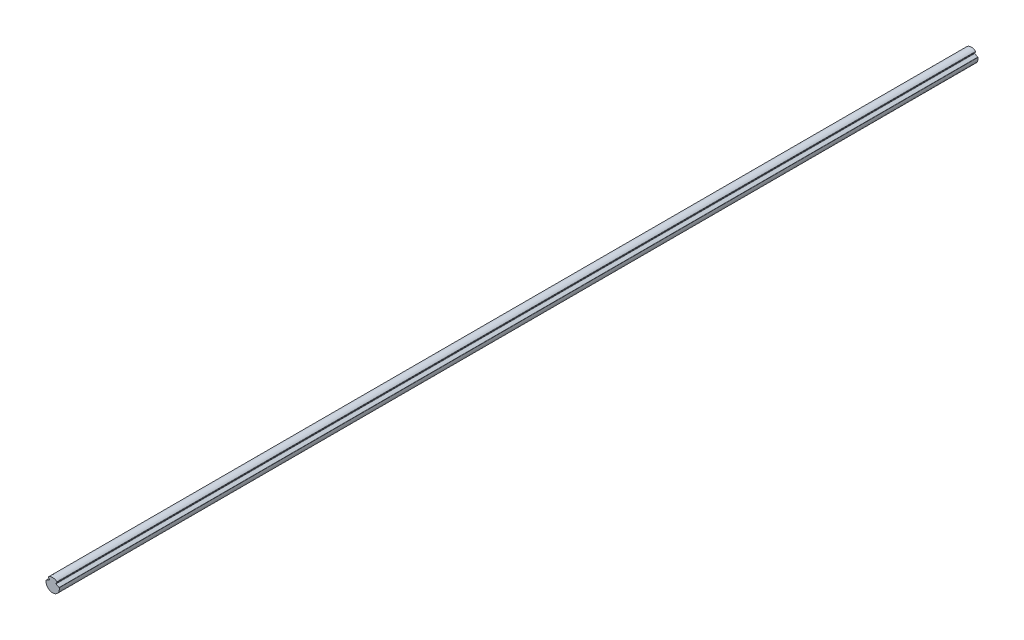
ISO-10303-21;
HEADER;
FILE_DESCRIPTION(('STEP AP214'),'2;1');
FILE_NAME('part.step','',(''),(''),'','','');
FILE_SCHEMA(('AUTOMOTIVE_DESIGN { 1 0 10303 214 1 1 1 1 }'));
ENDSEC;
DATA;
#1=APPLICATION_CONTEXT('core data for automotive mechanical design processes');
#2=APPLICATION_PROTOCOL_DEFINITION('international standard','automotive_design',2000,#1);
#3=PRODUCT_CONTEXT('',#1,'mechanical');
#4=PRODUCT('Part','Part','',(#3));
#5=PRODUCT_RELATED_PRODUCT_CATEGORY('part','',(#4));
#6=PRODUCT_DEFINITION_FORMATION('','',#4);
#7=PRODUCT_DEFINITION_CONTEXT('part definition',#1,'design');
#8=PRODUCT_DEFINITION('design','',#6,#7);
#9=PRODUCT_DEFINITION_SHAPE('','',#8);
#10=(LENGTH_UNIT() NAMED_UNIT(*) SI_UNIT(.MILLI.,.METRE.));
#11=(NAMED_UNIT(*) PLANE_ANGLE_UNIT() SI_UNIT($,.RADIAN.));
#12=(NAMED_UNIT(*) SI_UNIT($,.STERADIAN.) SOLID_ANGLE_UNIT());
#13=UNCERTAINTY_MEASURE_WITH_UNIT(LENGTH_MEASURE(1.E-05),#10,'distance_accuracy_value','');
#14=(GEOMETRIC_REPRESENTATION_CONTEXT(3) GLOBAL_UNCERTAINTY_ASSIGNED_CONTEXT((#13)) GLOBAL_UNIT_ASSIGNED_CONTEXT((#10,
#11,#12)) REPRESENTATION_CONTEXT('',''));
#15=CARTESIAN_POINT('',(0.,0.,0.));
#16=DIRECTION('',(0.,0.,1.));
#17=DIRECTION('',(1.,0.,0.));
#18=AXIS2_PLACEMENT_3D('',#15,#16,#17);
#19=CARTESIAN_POINT('',(-4.37305574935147,5.27246464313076,1000.));
#20=DIRECTION('',(0.,0.,-1.));
#21=DIRECTION('',(-1.,0.,0.));
#22=AXIS2_PLACEMENT_3D('',#19,#20,#21);
#23=CYLINDRICAL_SURFACE('',#22,0.400000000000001);
#24=CARTESIAN_POINT('',(-4.37305574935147,5.27246464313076,0.));
#25=DIRECTION('',(0.,0.,1.));
#26=DIRECTION('',(-1.,0.,0.));
#27=AXIS2_PLACEMENT_3D('',#24,#25,#26);
#28=CIRCLE('',#27,0.400000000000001);
#29=CARTESIAN_POINT('',(-4.62841666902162,5.58034579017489,0.));
#30=VERTEX_POINT('',#29);
#31=CARTESIAN_POINT('',(-4.68391413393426,5.02073648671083,0.));
#32=VERTEX_POINT('',#31);
#33=EDGE_CURVE('E158',#30,#32,#28,.T.);
#34=ORIENTED_EDGE('',*,*,#33,.T.);
#35=DIRECTION('',(0.,0.,-1.));
#36=VECTOR('',#35,1.);
#37=CARTESIAN_POINT('',(-4.68391413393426,5.02073648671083,1000.));
#38=LINE('',#37,#36);
#39=CARTESIAN_POINT('',(-4.68391413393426,5.02073648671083,1000.));
#40=VERTEX_POINT('',#39);
#41=EDGE_CURVE('E11',#40,#32,#38,.T.);
#42=ORIENTED_EDGE('',*,*,#41,.F.);
#43=CARTESIAN_POINT('',(-4.37305574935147,5.27246464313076,1000.));
#44=DIRECTION('',(0.,0.,1.));
#45=DIRECTION('',(-1.,0.,0.));
#46=AXIS2_PLACEMENT_3D('',#43,#44,#45);
#47=CIRCLE('',#46,0.400000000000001);
#48=CARTESIAN_POINT('',(-4.62841666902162,5.58034579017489,1000.));
#49=VERTEX_POINT('',#48);
#50=EDGE_CURVE('E180',#49,#40,#47,.T.);
#51=ORIENTED_EDGE('',*,*,#50,.F.);
#52=DIRECTION('',(0.,0.,-1.));
#53=VECTOR('',#52,1.);
#54=CARTESIAN_POINT('',(-4.62841666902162,5.58034579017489,1000.));
#55=LINE('',#54,#53);
#56=EDGE_CURVE('E154',#49,#30,#55,.T.);
#57=ORIENTED_EDGE('',*,*,#56,.T.);
#58=EDGE_LOOP('',(#34,#42,#51,#57));
#59=FACE_BOUND('',#58,.T.);
#60=ADVANCED_FACE('F38',(#59),#23,.T.);
#61=CARTESIAN_POINT('',(-3.56085838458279,3.63387813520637,1000.));
#62=DIRECTION('',(0.777145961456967,0.629320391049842,0.));
#63=DIRECTION('',(-0.629320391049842,0.777145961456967,0.));
#64=AXIS2_PLACEMENT_3D('',#61,#62,#63);
#65=PLANE('',#64);
#66=DIRECTION('',(0.629320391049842,-0.777145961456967,0.));
#67=VECTOR('',#66,1.);
#68=CARTESIAN_POINT('',(-3.56085838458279,3.63387813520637,0.));
#69=LINE('',#68,#67);
#70=CARTESIAN_POINT('',(-3.56085838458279,3.63387813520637,0.));
#71=VERTEX_POINT('',#70);
#72=EDGE_CURVE('E161',#32,#71,#69,.T.);
#73=ORIENTED_EDGE('',*,*,#72,.T.);
#74=DIRECTION('',(0.,0.,-1.));
#75=VECTOR('',#74,1.);
#76=CARTESIAN_POINT('',(-3.56085838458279,3.63387813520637,1000.));
#77=LINE('',#76,#75);
#78=CARTESIAN_POINT('',(-3.56085838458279,3.63387813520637,1000.));
#79=VERTEX_POINT('',#78);
#80=EDGE_CURVE('E46',#79,#71,#77,.T.);
#81=ORIENTED_EDGE('',*,*,#80,.F.);
#82=DIRECTION('',(0.629320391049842,-0.777145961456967,0.));
#83=VECTOR('',#82,1.);
#84=CARTESIAN_POINT('',(-3.56085838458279,3.63387813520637,1000.));
#85=LINE('',#84,#83);
#86=EDGE_CURVE('E109',#40,#79,#85,.T.);
#87=ORIENTED_EDGE('',*,*,#86,.F.);
#88=ORIENTED_EDGE('',*,*,#41,.T.);
#89=EDGE_LOOP('',(#73,#81,#87,#88));
#90=FACE_BOUND('',#89,.T.);
#91=ADVANCED_FACE('F258',(#90),#65,.F.);
#92=CARTESIAN_POINT('',(-3.87171676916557,3.38214997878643,1000.));
#93=DIRECTION('',(0.,0.,-1.));
#94=DIRECTION('',(-1.,0.,0.));
#95=AXIS2_PLACEMENT_3D('',#92,#93,#94);
#96=CYLINDRICAL_SURFACE('',#95,0.4);
#97=CARTESIAN_POINT('',(-3.87171676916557,3.38214997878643,0.));
#98=DIRECTION('',(0.,0.,-1.));
#99=DIRECTION('',(1.,0.,0.));
#100=AXIS2_PLACEMENT_3D('',#97,#98,#99);
#101=CIRCLE('',#100,0.4);
#102=CARTESIAN_POINT('',(-3.69012056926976,3.02574736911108,0.));
#103=VERTEX_POINT('',#102);
#104=EDGE_CURVE('E163',#71,#103,#101,.T.);
#105=ORIENTED_EDGE('',*,*,#104,.T.);
#106=DIRECTION('',(0.,0.,-1.));
#107=VECTOR('',#106,1.);
#108=CARTESIAN_POINT('',(-3.69012056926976,3.02574736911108,1000.));
#109=LINE('',#108,#107);
#110=CARTESIAN_POINT('',(-3.69012056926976,3.02574736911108,1000.));
#111=VERTEX_POINT('',#110);
#112=EDGE_CURVE('E199',#111,#103,#109,.T.);
#113=ORIENTED_EDGE('',*,*,#112,.F.);
#114=CARTESIAN_POINT('',(-3.87171676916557,3.38214997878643,1000.));
#115=DIRECTION('',(0.,0.,-1.));
#116=DIRECTION('',(1.,0.,0.));
#117=AXIS2_PLACEMENT_3D('',#114,#115,#116);
#118=CIRCLE('',#117,0.4);
#119=EDGE_CURVE('E207',#79,#111,#118,.T.);
#120=ORIENTED_EDGE('',*,*,#119,.F.);
#121=ORIENTED_EDGE('',*,*,#80,.T.);
#122=EDGE_LOOP('',(#105,#113,#120,#121));
#123=FACE_BOUND('',#122,.T.);
#124=ADVANCED_FACE('F205',(#123),#96,.F.);
#125=CARTESIAN_POINT('',(-3.69012056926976,3.02574736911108,1000.));
#126=DIRECTION('',(0.453990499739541,-0.891006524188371,0.));
#127=DIRECTION('',(0.891006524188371,0.453990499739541,0.));
#128=AXIS2_PLACEMENT_3D('',#125,#126,#127);
#129=PLANE('',#128);
#130=DIRECTION('',(-0.891006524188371,-0.453990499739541,0.));
#131=VECTOR('',#130,1.);
#132=CARTESIAN_POINT('',(-3.69012056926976,3.02574736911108,0.));
#133=LINE('',#132,#131);
#134=CARTESIAN_POINT('',(-6.95754338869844,1.36091228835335,0.));
#135=VERTEX_POINT('',#134);
#136=EDGE_CURVE('E165',#103,#135,#133,.T.);
#137=ORIENTED_EDGE('',*,*,#136,.T.);
#138=DIRECTION('',(0.,0.,-1.));
#139=VECTOR('',#138,1.);
#140=CARTESIAN_POINT('',(-6.95754338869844,1.36091228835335,1000.));
#141=LINE('',#140,#139);
#142=CARTESIAN_POINT('',(-6.95754338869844,1.36091228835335,1000.));
#143=VERTEX_POINT('',#142);
#144=EDGE_CURVE('E196',#143,#135,#141,.T.);
#145=ORIENTED_EDGE('',*,*,#144,.F.);
#146=DIRECTION('',(-0.891006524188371,-0.453990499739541,0.));
#147=VECTOR('',#146,1.);
#148=CARTESIAN_POINT('',(-3.69012056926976,3.02574736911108,1000.));
#149=LINE('',#148,#147);
#150=EDGE_CURVE('E225',#111,#143,#149,.T.);
#151=ORIENTED_EDGE('',*,*,#150,.F.);
#152=ORIENTED_EDGE('',*,*,#112,.T.);
#153=EDGE_LOOP('',(#137,#145,#151,#152));
#154=FACE_BOUND('',#153,.T.);
#155=ADVANCED_FACE('F216',(#154),#129,.F.);
#156=CARTESIAN_POINT('',(-6.77594718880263,1.004509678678,1000.));
#157=DIRECTION('',(0.,0.,-1.));
#158=DIRECTION('',(-1.,0.,0.));
#159=AXIS2_PLACEMENT_3D('',#156,#157,#158);
#160=CYLINDRICAL_SURFACE('',#159,0.400000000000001);
#161=CARTESIAN_POINT('',(-6.77594718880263,1.004509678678,0.));
#162=DIRECTION('',(0.,0.,1.));
#163=DIRECTION('',(1.,0.,0.));
#164=AXIS2_PLACEMENT_3D('',#161,#162,#163);
#165=CIRCLE('',#164,0.400000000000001);
#166=CARTESIAN_POINT('',(-7.17162293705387,1.06316717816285,0.));
#167=VERTEX_POINT('',#166);
#168=EDGE_CURVE('E167',#135,#167,#165,.T.);
#169=ORIENTED_EDGE('',*,*,#168,.T.);
#170=DIRECTION('',(0.,0.,-1.));
#171=VECTOR('',#170,1.);
#172=CARTESIAN_POINT('',(-7.17162293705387,1.06316717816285,1000.));
#173=LINE('',#172,#171);
#174=CARTESIAN_POINT('',(-7.17162293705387,1.06316717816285,1000.));
#175=VERTEX_POINT('',#174);
#176=EDGE_CURVE('E193',#175,#167,#173,.T.);
#177=ORIENTED_EDGE('',*,*,#176,.F.);
#178=CARTESIAN_POINT('',(-6.77594718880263,1.004509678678,1000.));
#179=DIRECTION('',(0.,0.,1.));
#180=DIRECTION('',(1.,0.,0.));
#181=AXIS2_PLACEMENT_3D('',#178,#179,#180);
#182=CIRCLE('',#181,0.400000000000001);
#183=EDGE_CURVE('E222',#143,#175,#182,.T.);
#184=ORIENTED_EDGE('',*,*,#183,.F.);
#185=ORIENTED_EDGE('',*,*,#144,.T.);
#186=EDGE_LOOP('',(#169,#177,#184,#185));
#187=FACE_BOUND('',#186,.T.);
#188=ADVANCED_FACE('F220',(#187),#160,.T.);
#189=CARTESIAN_POINT('',(0.,0.,1000.));
#190=DIRECTION('',(0.,0.,-1.));
#191=DIRECTION('',(-1.,0.,0.));
#192=AXIS2_PLACEMENT_3D('',#189,#190,#191);
#193=CYLINDRICAL_SURFACE('',#192,7.24999999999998);
#194=CARTESIAN_POINT('',(0.,0.,0.));
#195=DIRECTION('',(0.,0.,1.));
#196=DIRECTION('',(1.,0.,0.));
#197=AXIS2_PLACEMENT_3D('',#194,#195,#196);
#198=CIRCLE('',#197,7.24999999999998);
#199=CARTESIAN_POINT('',(7.17162293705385,1.06316717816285,0.));
#200=VERTEX_POINT('',#199);
#201=EDGE_CURVE('E169',#167,#200,#198,.T.);
#202=ORIENTED_EDGE('',*,*,#201,.T.);
#203=DIRECTION('',(0.,0.,-1.));
#204=VECTOR('',#203,1.);
#205=CARTESIAN_POINT('',(7.17162293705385,1.06316717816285,1000.));
#206=LINE('',#205,#204);
#207=CARTESIAN_POINT('',(7.17162293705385,1.06316717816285,1000.));
#208=VERTEX_POINT('',#207);
#209=EDGE_CURVE('E190',#208,#200,#206,.T.);
#210=ORIENTED_EDGE('',*,*,#209,.F.);
#211=CARTESIAN_POINT('',(0.,0.,1000.));
#212=DIRECTION('',(0.,0.,1.));
#213=DIRECTION('',(1.,0.,0.));
#214=AXIS2_PLACEMENT_3D('',#211,#212,#213);
#215=CIRCLE('',#214,7.24999999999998);
#216=EDGE_CURVE('E224',#175,#208,#215,.T.);
#217=ORIENTED_EDGE('',*,*,#216,.F.);
#218=ORIENTED_EDGE('',*,*,#176,.T.);
#219=EDGE_LOOP('',(#202,#210,#217,#218));
#220=FACE_BOUND('',#219,.T.);
#221=ADVANCED_FACE('F271',(#220),#193,.T.);
#222=CARTESIAN_POINT('',(6.77594718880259,1.004509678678,1000.));
#223=DIRECTION('',(0.,0.,-1.));
#224=DIRECTION('',(-1.,0.,0.));
#225=AXIS2_PLACEMENT_3D('',#222,#223,#224);
#226=CYLINDRICAL_SURFACE('',#225,0.400000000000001);
#227=CARTESIAN_POINT('',(6.77594718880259,1.004509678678,0.));
#228=DIRECTION('',(0.,0.,1.));
#229=DIRECTION('',(-1.,0.,0.));
#230=AXIS2_PLACEMENT_3D('',#227,#228,#229);
#231=CIRCLE('',#230,0.400000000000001);
#232=CARTESIAN_POINT('',(6.9575433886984,1.36091228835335,0.));
#233=VERTEX_POINT('',#232);
#234=EDGE_CURVE('E171',#200,#233,#231,.T.);
#235=ORIENTED_EDGE('',*,*,#234,.T.);
#236=DIRECTION('',(0.,0.,-1.));
#237=VECTOR('',#236,1.);
#238=CARTESIAN_POINT('',(6.9575433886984,1.36091228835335,1000.));
#239=LINE('',#238,#237);
#240=CARTESIAN_POINT('',(6.9575433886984,1.36091228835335,1000.));
#241=VERTEX_POINT('',#240);
#242=EDGE_CURVE('E187',#241,#233,#239,.T.);
#243=ORIENTED_EDGE('',*,*,#242,.F.);
#244=CARTESIAN_POINT('',(6.77594718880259,1.004509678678,1000.));
#245=DIRECTION('',(0.,0.,1.));
#246=DIRECTION('',(-1.,0.,0.));
#247=AXIS2_PLACEMENT_3D('',#244,#245,#246);
#248=CIRCLE('',#247,0.400000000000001);
#249=EDGE_CURVE('E227',#208,#241,#248,.T.);
#250=ORIENTED_EDGE('',*,*,#249,.F.);
#251=ORIENTED_EDGE('',*,*,#209,.T.);
#252=EDGE_LOOP('',(#235,#243,#250,#251));
#253=FACE_BOUND('',#252,.T.);
#254=ADVANCED_FACE('F274',(#253),#226,.T.);
#255=CARTESIAN_POINT('',(3.69012056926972,3.02574736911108,1000.));
#256=DIRECTION('',(-0.453990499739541,-0.891006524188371,0.));
#257=DIRECTION('',(0.891006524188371,-0.453990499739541,0.));
#258=AXIS2_PLACEMENT_3D('',#255,#256,#257);
#259=PLANE('',#258);
#260=DIRECTION('',(-0.891006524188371,0.453990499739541,0.));
#261=VECTOR('',#260,1.);
#262=CARTESIAN_POINT('',(3.69012056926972,3.02574736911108,0.));
#263=LINE('',#262,#261);
#264=CARTESIAN_POINT('',(3.69012056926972,3.02574736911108,0.));
#265=VERTEX_POINT('',#264);
#266=EDGE_CURVE('E173',#233,#265,#263,.T.);
#267=ORIENTED_EDGE('',*,*,#266,.T.);
#268=DIRECTION('',(0.,0.,-1.));
#269=VECTOR('',#268,1.);
#270=CARTESIAN_POINT('',(3.69012056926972,3.02574736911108,1000.));
#271=LINE('',#270,#269);
#272=CARTESIAN_POINT('',(3.69012056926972,3.02574736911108,1000.));
#273=VERTEX_POINT('',#272);
#274=EDGE_CURVE('E184',#273,#265,#271,.T.);
#275=ORIENTED_EDGE('',*,*,#274,.F.);
#276=DIRECTION('',(-0.891006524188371,0.453990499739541,0.));
#277=VECTOR('',#276,1.);
#278=CARTESIAN_POINT('',(3.69012056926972,3.02574736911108,1000.));
#279=LINE('',#278,#277);
#280=EDGE_CURVE('E233',#241,#273,#279,.T.);
#281=ORIENTED_EDGE('',*,*,#280,.F.);
#282=ORIENTED_EDGE('',*,*,#242,.T.);
#283=EDGE_LOOP('',(#267,#275,#281,#282));
#284=FACE_BOUND('',#283,.T.);
#285=ADVANCED_FACE('F239',(#284),#259,.F.);
#286=CARTESIAN_POINT('',(3.87171676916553,3.38214997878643,1000.));
#287=DIRECTION('',(0.,0.,-1.));
#288=DIRECTION('',(-1.,0.,0.));
#289=AXIS2_PLACEMENT_3D('',#286,#287,#288);
#290=CYLINDRICAL_SURFACE('',#289,0.4);
#291=CARTESIAN_POINT('',(3.87171676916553,3.38214997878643,0.));
#292=DIRECTION('',(0.,0.,-1.));
#293=DIRECTION('',(-1.,0.,0.));
#294=AXIS2_PLACEMENT_3D('',#291,#292,#293);
#295=CIRCLE('',#294,0.4);
#296=CARTESIAN_POINT('',(3.56085838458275,3.63387813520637,0.));
#297=VERTEX_POINT('',#296);
#298=EDGE_CURVE('E175',#265,#297,#295,.T.);
#299=ORIENTED_EDGE('',*,*,#298,.T.);
#300=DIRECTION('',(0.,0.,-1.));
#301=VECTOR('',#300,1.);
#302=CARTESIAN_POINT('',(3.56085838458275,3.63387813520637,1000.));
#303=LINE('',#302,#301);
#304=CARTESIAN_POINT('',(3.56085838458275,3.63387813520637,1000.));
#305=VERTEX_POINT('',#304);
#306=EDGE_CURVE('E149',#305,#297,#303,.T.);
#307=ORIENTED_EDGE('',*,*,#306,.F.);
#308=CARTESIAN_POINT('',(3.87171676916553,3.38214997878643,1000.));
#309=DIRECTION('',(0.,0.,-1.));
#310=DIRECTION('',(-1.,0.,0.));
#311=AXIS2_PLACEMENT_3D('',#308,#309,#310);
#312=CIRCLE('',#311,0.4);
#313=EDGE_CURVE('E140',#273,#305,#312,.T.);
#314=ORIENTED_EDGE('',*,*,#313,.F.);
#315=ORIENTED_EDGE('',*,*,#274,.T.);
#316=EDGE_LOOP('',(#299,#307,#314,#315));
#317=FACE_BOUND('',#316,.T.);
#318=ADVANCED_FACE('F243',(#317),#290,.F.);
#319=CARTESIAN_POINT('',(3.56085838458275,3.63387813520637,1000.));
#320=DIRECTION('',(-0.777145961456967,0.629320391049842,0.));
#321=DIRECTION('',(-0.629320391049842,-0.777145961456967,0.));
#322=AXIS2_PLACEMENT_3D('',#319,#320,#321);
#323=PLANE('',#322);
#324=DIRECTION('',(0.629320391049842,0.777145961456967,0.));
#325=VECTOR('',#324,1.);
#326=CARTESIAN_POINT('',(3.56085838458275,3.63387813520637,0.));
#327=LINE('',#326,#325);
#328=CARTESIAN_POINT('',(4.68391413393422,5.02073648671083,0.));
#329=VERTEX_POINT('',#328);
#330=EDGE_CURVE('E148',#297,#329,#327,.T.);
#331=ORIENTED_EDGE('',*,*,#330,.T.);
#332=DIRECTION('',(0.,0.,-1.));
#333=VECTOR('',#332,1.);
#334=CARTESIAN_POINT('',(4.68391413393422,5.02073648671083,1000.));
#335=LINE('',#334,#333);
#336=CARTESIAN_POINT('',(4.68391413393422,5.02073648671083,1000.));
#337=VERTEX_POINT('',#336);
#338=EDGE_CURVE('E145',#337,#329,#335,.T.);
#339=ORIENTED_EDGE('',*,*,#338,.F.);
#340=DIRECTION('',(0.629320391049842,0.777145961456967,0.));
#341=VECTOR('',#340,1.);
#342=CARTESIAN_POINT('',(3.56085838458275,3.63387813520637,1000.));
#343=LINE('',#342,#341);
#344=EDGE_CURVE('E134',#305,#337,#343,.T.);
#345=ORIENTED_EDGE('',*,*,#344,.F.);
#346=ORIENTED_EDGE('',*,*,#306,.T.);
#347=EDGE_LOOP('',(#331,#339,#345,#346));
#348=FACE_BOUND('',#347,.T.);
#349=ADVANCED_FACE('F146',(#348),#323,.F.);
#350=CARTESIAN_POINT('',(4.37305574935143,5.27246464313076,1000.));
#351=DIRECTION('',(0.,0.,-1.));
#352=DIRECTION('',(-1.,0.,0.));
#353=AXIS2_PLACEMENT_3D('',#350,#351,#352);
#354=CYLINDRICAL_SURFACE('',#353,0.400000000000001);
#355=CARTESIAN_POINT('',(4.37305574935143,5.27246464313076,0.));
#356=DIRECTION('',(0.,0.,1.));
#357=DIRECTION('',(1.,0.,0.));
#358=AXIS2_PLACEMENT_3D('',#355,#356,#357);
#359=CIRCLE('',#358,0.400000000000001);
#360=CARTESIAN_POINT('',(4.62841666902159,5.5803457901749,0.));
#361=VERTEX_POINT('',#360);
#362=EDGE_CURVE('E95',#329,#361,#359,.T.);
#363=ORIENTED_EDGE('',*,*,#362,.T.);
#364=DIRECTION('',(0.,0.,-1.));
#365=VECTOR('',#364,1.);
#366=CARTESIAN_POINT('',(4.62841666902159,5.5803457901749,1000.));
#367=LINE('',#366,#365);
#368=CARTESIAN_POINT('',(4.62841666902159,5.5803457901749,1000.));
#369=VERTEX_POINT('',#368);
#370=EDGE_CURVE('E150',#369,#361,#367,.T.);
#371=ORIENTED_EDGE('',*,*,#370,.F.);
#372=CARTESIAN_POINT('',(4.37305574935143,5.27246464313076,1000.));
#373=DIRECTION('',(0.,0.,1.));
#374=DIRECTION('',(1.,0.,0.));
#375=AXIS2_PLACEMENT_3D('',#372,#373,#374);
#376=CIRCLE('',#375,0.400000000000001);
#377=EDGE_CURVE('E138',#337,#369,#376,.T.);
#378=ORIENTED_EDGE('',*,*,#377,.F.);
#379=ORIENTED_EDGE('',*,*,#338,.T.);
#380=EDGE_LOOP('',(#363,#371,#378,#379));
#381=FACE_BOUND('',#380,.T.);
#382=ADVANCED_FACE('F152',(#381),#354,.T.);
#383=CARTESIAN_POINT('',(0.,0.,1000.));
#384=DIRECTION('',(0.,0.,-1.));
#385=DIRECTION('',(-1.,0.,0.));
#386=AXIS2_PLACEMENT_3D('',#383,#384,#385);
#387=CYLINDRICAL_SURFACE('',#386,7.24999999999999);
#388=CARTESIAN_POINT('',(0.,0.,0.));
#389=DIRECTION('',(0.,0.,1.));
#390=DIRECTION('',(1.,0.,0.));
#391=AXIS2_PLACEMENT_3D('',#388,#389,#390);
#392=CIRCLE('',#391,7.24999999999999);
#393=EDGE_CURVE('E101',#361,#30,#392,.T.);
#394=ORIENTED_EDGE('',*,*,#393,.T.);
#395=ORIENTED_EDGE('',*,*,#56,.F.);
#396=CARTESIAN_POINT('',(0.,0.,1000.));
#397=DIRECTION('',(0.,0.,1.));
#398=DIRECTION('',(1.,0.,0.));
#399=AXIS2_PLACEMENT_3D('',#396,#397,#398);
#400=CIRCLE('',#399,7.24999999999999);
#401=EDGE_CURVE('E54',#369,#49,#400,.T.);
#402=ORIENTED_EDGE('',*,*,#401,.F.);
#403=ORIENTED_EDGE('',*,*,#370,.T.);
#404=EDGE_LOOP('',(#394,#395,#402,#403));
#405=FACE_BOUND('',#404,.T.);
#406=ADVANCED_FACE('F247',(#405),#387,.T.);
#407=CARTESIAN_POINT('',(-4.37305574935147,5.27246464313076,1000.));
#408=DIRECTION('',(0.,0.,-1.));
#409=DIRECTION('',(-1.,0.,0.));
#410=AXIS2_PLACEMENT_3D('',#407,#408,#409);
#411=PLANE('',#410);
#412=ORIENTED_EDGE('',*,*,#50,.T.);
#413=ORIENTED_EDGE('',*,*,#86,.T.);
#414=ORIENTED_EDGE('',*,*,#119,.T.);
#415=ORIENTED_EDGE('',*,*,#150,.T.);
#416=ORIENTED_EDGE('',*,*,#183,.T.);
#417=ORIENTED_EDGE('',*,*,#216,.T.);
#418=ORIENTED_EDGE('',*,*,#249,.T.);
#419=ORIENTED_EDGE('',*,*,#280,.T.);
#420=ORIENTED_EDGE('',*,*,#313,.T.);
#421=ORIENTED_EDGE('',*,*,#344,.T.);
#422=ORIENTED_EDGE('',*,*,#377,.T.);
#423=ORIENTED_EDGE('',*,*,#401,.T.);
#424=EDGE_LOOP('',(#412,#413,#414,#415,#416,#417,#418,#419,#420,#421,#422,#423));
#425=FACE_BOUND('',#424,.T.);
#426=ADVANCED_FACE('F136',(#425),#411,.F.);
#427=CARTESIAN_POINT('',(-4.37305574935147,5.27246464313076,0.));
#428=DIRECTION('',(0.,0.,-1.));
#429=DIRECTION('',(-1.,0.,0.));
#430=AXIS2_PLACEMENT_3D('',#427,#428,#429);
#431=PLANE('',#430);
#432=ORIENTED_EDGE('',*,*,#33,.F.);
#433=ORIENTED_EDGE('',*,*,#393,.F.);
#434=ORIENTED_EDGE('',*,*,#362,.F.);
#435=ORIENTED_EDGE('',*,*,#330,.F.);
#436=ORIENTED_EDGE('',*,*,#298,.F.);
#437=ORIENTED_EDGE('',*,*,#266,.F.);
#438=ORIENTED_EDGE('',*,*,#234,.F.);
#439=ORIENTED_EDGE('',*,*,#201,.F.);
#440=ORIENTED_EDGE('',*,*,#168,.F.);
#441=ORIENTED_EDGE('',*,*,#136,.F.);
#442=ORIENTED_EDGE('',*,*,#104,.F.);
#443=ORIENTED_EDGE('',*,*,#72,.F.);
#444=EDGE_LOOP('',(#432,#433,#434,#435,#436,#437,#438,#439,#440,#441,#442,#443));
#445=FACE_BOUND('',#444,.T.);
#446=ADVANCED_FACE('F211',(#445),#431,.T.);
#447=CLOSED_SHELL('',(#60,#91,#124,#155,#188,#221,#254,#285,#318,#349,#382,#406,#426,#446));
#448=MANIFOLD_SOLID_BREP('B2',#447);
#449=ADVANCED_BREP_SHAPE_REPRESENTATION('',(#18,#448),#14);
#450=SHAPE_DEFINITION_REPRESENTATION(#9,#449);
ENDSEC;
END-ISO-10303-21;
